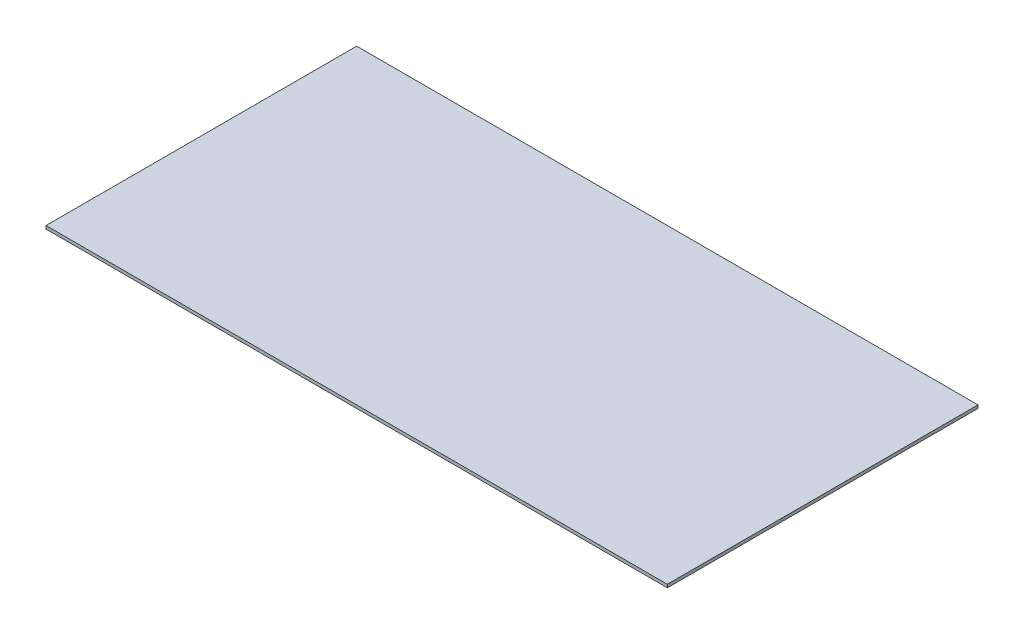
from build123d import *

# Parameters (mm, degrees)
ESQUISSE1_W      = 2000
ESQUISSE1_H      = 1000
EXTRUSION1_DEPTH = 10


with BuildPart() as part:
    # Esquisse1 → Extrusion1 (new body)
    with BuildSketch(Plane(origin=(0, 0, 0), x_dir=(1, 0, 0), z_dir=(0, 1, 0))):
        with Locations((-1000, 0)):
            Rectangle(ESQUISSE1_W, ESQUISSE1_H)
    extrude(amount=EXTRUSION1_DEPTH)


solid = part.part
